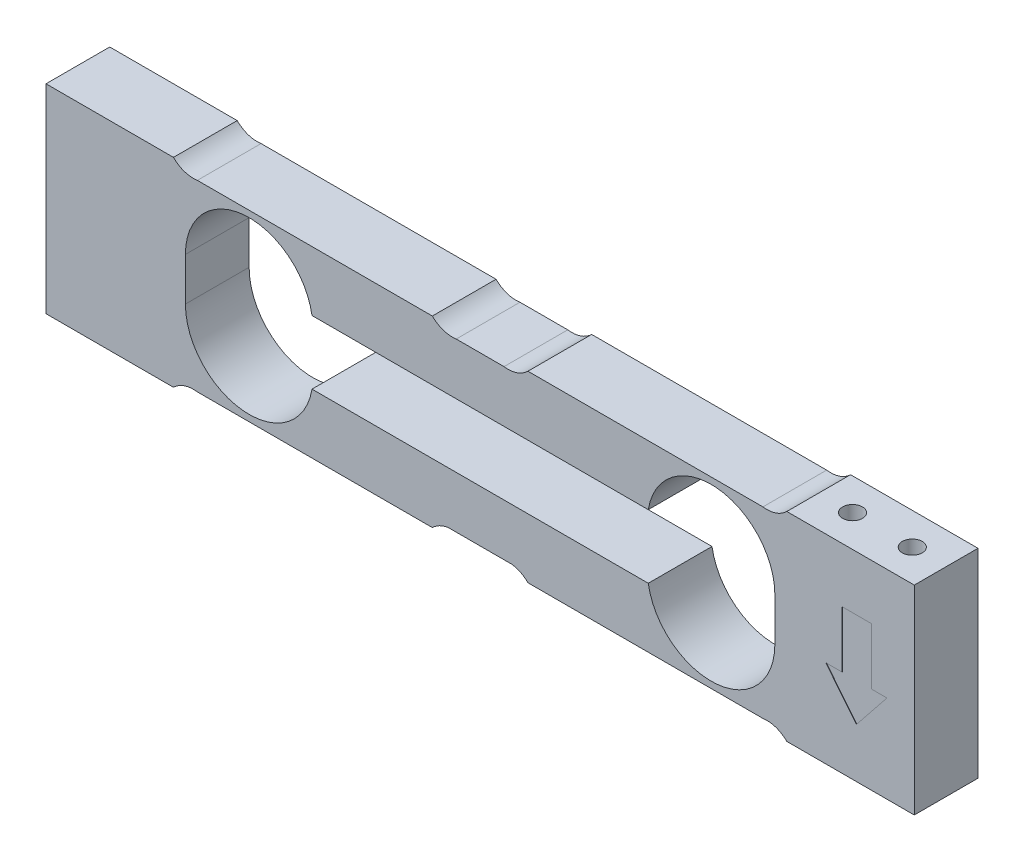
ISO-10303-21;
HEADER;
FILE_DESCRIPTION(('STEP AP214'),'2;1');
FILE_NAME('part.step','',(''),(''),'','','');
FILE_SCHEMA(('AUTOMOTIVE_DESIGN { 1 0 10303 214 1 1 1 1 }'));
ENDSEC;
DATA;
#1=APPLICATION_CONTEXT('core data for automotive mechanical design processes');
#2=APPLICATION_PROTOCOL_DEFINITION('international standard','automotive_design',2000,#1);
#3=PRODUCT_CONTEXT('',#1,'mechanical');
#4=PRODUCT('Part','Part','',(#3));
#5=PRODUCT_RELATED_PRODUCT_CATEGORY('part','',(#4));
#6=PRODUCT_DEFINITION_FORMATION('','',#4);
#7=PRODUCT_DEFINITION_CONTEXT('part definition',#1,'design');
#8=PRODUCT_DEFINITION('design','',#6,#7);
#9=PRODUCT_DEFINITION_SHAPE('','',#8);
#10=(LENGTH_UNIT() NAMED_UNIT(*) SI_UNIT(.MILLI.,.METRE.));
#11=(NAMED_UNIT(*) PLANE_ANGLE_UNIT() SI_UNIT($,.RADIAN.));
#12=(NAMED_UNIT(*) SI_UNIT($,.STERADIAN.) SOLID_ANGLE_UNIT());
#13=UNCERTAINTY_MEASURE_WITH_UNIT(LENGTH_MEASURE(1.E-05),#10,'distance_accuracy_value','');
#14=(GEOMETRIC_REPRESENTATION_CONTEXT(3) GLOBAL_UNCERTAINTY_ASSIGNED_CONTEXT((#13)) GLOBAL_UNIT_ASSIGNED_CONTEXT((#10,
#11,#12)) REPRESENTATION_CONTEXT('',''));
#15=CARTESIAN_POINT('',(0.,0.,0.));
#16=DIRECTION('',(0.,0.,1.));
#17=DIRECTION('',(1.,0.,0.));
#18=AXIS2_PLACEMENT_3D('',#15,#16,#17);
#19=CARTESIAN_POINT('',(219.735608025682,103.,8.));
#20=DIRECTION('',(0.,0.,1.));
#21=DIRECTION('',(1.,0.,0.));
#22=AXIS2_PLACEMENT_3D('',#19,#20,#21);
#23=PLANE('',#22);
#24=DIRECTION('',(0.,-1.,0.));
#25=VECTOR('',#24,1.);
#26=CARTESIAN_POINT('',(261.649638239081,122.620865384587,8.));
#27=LINE('',#26,#25);
#28=CARTESIAN_POINT('',(261.649638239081,122.620865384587,8.));
#29=VERTEX_POINT('',#28);
#30=CARTESIAN_POINT('',(261.649638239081,115.508562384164,8.));
#31=VERTEX_POINT('',#30);
#32=EDGE_CURVE('E45',#29,#31,#27,.T.);
#33=ORIENTED_EDGE('',*,*,#32,.F.);
#34=DIRECTION('',(-1.,0.,0.));
#35=VECTOR('',#34,1.);
#36=CARTESIAN_POINT('',(265.387022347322,122.620865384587,8.));
#37=LINE('',#36,#35);
#38=CARTESIAN_POINT('',(265.387022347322,122.620865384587,8.));
#39=VERTEX_POINT('',#38);
#40=EDGE_CURVE('E290',#39,#29,#37,.T.);
#41=ORIENTED_EDGE('',*,*,#40,.F.);
#42=DIRECTION('',(0.,1.,0.));
#43=VECTOR('',#42,1.);
#44=CARTESIAN_POINT('',(265.387022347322,115.508562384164,8.));
#45=LINE('',#44,#43);
#46=CARTESIAN_POINT('',(265.387022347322,115.508562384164,8.));
#47=VERTEX_POINT('',#46);
#48=EDGE_CURVE('E293',#47,#39,#45,.T.);
#49=ORIENTED_EDGE('',*,*,#48,.F.);
#50=DIRECTION('',(-1.,0.,0.));
#51=VECTOR('',#50,1.);
#52=CARTESIAN_POINT('',(267.307022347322,115.508562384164,8.));
#53=LINE('',#52,#51);
#54=CARTESIAN_POINT('',(267.307022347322,115.508562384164,8.));
#55=VERTEX_POINT('',#54);
#56=EDGE_CURVE('E315',#55,#47,#53,.T.);
#57=ORIENTED_EDGE('',*,*,#56,.F.);
#58=DIRECTION('',(0.624695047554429,0.780868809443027,0.));
#59=VECTOR('',#58,1.);
#60=CARTESIAN_POINT('',(263.467022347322,110.708562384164,8.));
#61=LINE('',#60,#59);
#62=CARTESIAN_POINT('',(263.467022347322,110.708562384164,8.));
#63=VERTEX_POINT('',#62);
#64=EDGE_CURVE('E312',#63,#55,#61,.T.);
#65=ORIENTED_EDGE('',*,*,#64,.F.);
#66=DIRECTION('',(0.624695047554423,-0.780868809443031,0.));
#67=VECTOR('',#66,1.);
#68=CARTESIAN_POINT('',(259.627022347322,115.508562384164,8.));
#69=LINE('',#68,#67);
#70=CARTESIAN_POINT('',(259.627022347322,115.508562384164,8.));
#71=VERTEX_POINT('',#70);
#72=EDGE_CURVE('E309',#71,#63,#69,.T.);
#73=ORIENTED_EDGE('',*,*,#72,.F.);
#74=DIRECTION('',(-1.,0.,0.));
#75=VECTOR('',#74,1.);
#76=CARTESIAN_POINT('',(261.649638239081,115.508562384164,8.));
#77=LINE('',#76,#75);
#78=EDGE_CURVE('E307',#31,#71,#77,.T.);
#79=ORIENTED_EDGE('',*,*,#78,.F.);
#80=EDGE_LOOP('',(#33,#41,#49,#57,#65,#73,#79));
#81=FACE_BOUND('',#80,.T.);
#82=CARTESIAN_POINT('',(219.735608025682,103.,8.));
#83=DIRECTION('',(0.,0.,-1.));
#84=DIRECTION('',(1.,0.,0.));
#85=AXIS2_PLACEMENT_3D('',#82,#83,#84);
#86=CIRCLE('',#85,3.53553390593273);
#87=CARTESIAN_POINT('',(220.235608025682,106.5,8.));
#88=VERTEX_POINT('',#87);
#89=CARTESIAN_POINT('',(222.235608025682,105.5,8.));
#90=VERTEX_POINT('',#89);
#91=EDGE_CURVE('E413',#88,#90,#86,.T.);
#92=ORIENTED_EDGE('',*,*,#91,.T.);
#93=DIRECTION('',(1.,0.,0.));
#94=VECTOR('',#93,1.);
#95=CARTESIAN_POINT('',(222.235608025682,105.5,8.));
#96=LINE('',#95,#94);
#97=CARTESIAN_POINT('',(251.735608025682,105.5,8.));
#98=VERTEX_POINT('',#97);
#99=EDGE_CURVE('E416',#90,#98,#96,.T.);
#100=ORIENTED_EDGE('',*,*,#99,.T.);
#101=CARTESIAN_POINT('',(252.235608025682,102.,8.));
#102=DIRECTION('',(0.,0.,-1.));
#103=DIRECTION('',(1.,0.,0.));
#104=AXIS2_PLACEMENT_3D('',#101,#102,#103);
#105=CIRCLE('',#104,3.53553390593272);
#106=CARTESIAN_POINT('',(254.735608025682,104.5,8.));
#107=VERTEX_POINT('',#106);
#108=EDGE_CURVE('E419',#98,#107,#105,.T.);
#109=ORIENTED_EDGE('',*,*,#108,.T.);
#110=DIRECTION('',(1.,0.,0.));
#111=VECTOR('',#110,1.);
#112=CARTESIAN_POINT('',(254.735608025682,104.5,8.));
#113=LINE('',#112,#111);
#114=CARTESIAN_POINT('',(270.735608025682,104.5,8.));
#115=VERTEX_POINT('',#114);
#116=EDGE_CURVE('E421',#107,#115,#113,.T.);
#117=ORIENTED_EDGE('',*,*,#116,.T.);
#118=DIRECTION('',(0.,1.,0.));
#119=VECTOR('',#118,1.);
#120=CARTESIAN_POINT('',(270.735608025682,129.5,8.));
#121=LINE('',#120,#119);
#122=CARTESIAN_POINT('',(270.735608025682,129.5,8.));
#123=VERTEX_POINT('',#122);
#124=EDGE_CURVE('E423',#115,#123,#121,.T.);
#125=ORIENTED_EDGE('',*,*,#124,.T.);
#126=DIRECTION('',(-1.,0.,0.));
#127=VECTOR('',#126,1.);
#128=CARTESIAN_POINT('',(254.735608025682,129.5,8.));
#129=LINE('',#128,#127);
#130=CARTESIAN_POINT('',(254.735608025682,129.5,8.));
#131=VERTEX_POINT('',#130);
#132=EDGE_CURVE('E425',#123,#131,#129,.T.);
#133=ORIENTED_EDGE('',*,*,#132,.T.);
#134=CARTESIAN_POINT('',(252.235608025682,132.,8.));
#135=DIRECTION('',(0.,0.,-1.));
#136=DIRECTION('',(1.,0.,0.));
#137=AXIS2_PLACEMENT_3D('',#134,#135,#136);
#138=CIRCLE('',#137,3.53553390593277);
#139=CARTESIAN_POINT('',(251.735608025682,128.5,8.));
#140=VERTEX_POINT('',#139);
#141=EDGE_CURVE('E427',#131,#140,#138,.T.);
#142=ORIENTED_EDGE('',*,*,#141,.T.);
#143=DIRECTION('',(-1.,0.,0.));
#144=VECTOR('',#143,1.);
#145=CARTESIAN_POINT('',(222.235608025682,128.5,8.));
#146=LINE('',#145,#144);
#147=CARTESIAN_POINT('',(222.235608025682,128.5,8.));
#148=VERTEX_POINT('',#147);
#149=EDGE_CURVE('E429',#140,#148,#146,.T.);
#150=ORIENTED_EDGE('',*,*,#149,.T.);
#151=CARTESIAN_POINT('',(219.735608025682,131.,8.));
#152=DIRECTION('',(0.,0.,-1.));
#153=DIRECTION('',(1.,0.,0.));
#154=AXIS2_PLACEMENT_3D('',#151,#152,#153);
#155=CIRCLE('',#154,3.53553390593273);
#156=CARTESIAN_POINT('',(219.235608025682,127.5,8.));
#157=VERTEX_POINT('',#156);
#158=EDGE_CURVE('E431',#148,#157,#155,.T.);
#159=ORIENTED_EDGE('',*,*,#158,.T.);
#160=DIRECTION('',(-1.,0.,0.));
#161=VECTOR('',#160,1.);
#162=CARTESIAN_POINT('',(213.235608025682,127.5,8.));
#163=LINE('',#162,#161);
#164=CARTESIAN_POINT('',(213.235608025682,127.5,8.));
#165=VERTEX_POINT('',#164);
#166=EDGE_CURVE('E433',#157,#165,#163,.T.);
#167=ORIENTED_EDGE('',*,*,#166,.T.);
#168=CARTESIAN_POINT('',(212.735608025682,131.,8.));
#169=DIRECTION('',(0.,0.,-1.));
#170=DIRECTION('',(1.,0.,0.));
#171=AXIS2_PLACEMENT_3D('',#168,#169,#170);
#172=CIRCLE('',#171,3.53553390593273);
#173=CARTESIAN_POINT('',(210.235608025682,128.5,8.));
#174=VERTEX_POINT('',#173);
#175=EDGE_CURVE('E435',#165,#174,#172,.T.);
#176=ORIENTED_EDGE('',*,*,#175,.T.);
#177=DIRECTION('',(-1.,0.,0.));
#178=VECTOR('',#177,1.);
#179=CARTESIAN_POINT('',(180.735608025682,128.5,8.));
#180=LINE('',#179,#178);
#181=CARTESIAN_POINT('',(180.735608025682,128.5,8.));
#182=VERTEX_POINT('',#181);
#183=EDGE_CURVE('E437',#174,#182,#180,.T.);
#184=ORIENTED_EDGE('',*,*,#183,.T.);
#185=CARTESIAN_POINT('',(180.235608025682,132.,8.));
#186=DIRECTION('',(0.,0.,-1.));
#187=DIRECTION('',(1.,0.,0.));
#188=AXIS2_PLACEMENT_3D('',#185,#186,#187);
#189=CIRCLE('',#188,3.53553390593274);
#190=CARTESIAN_POINT('',(177.735608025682,129.5,8.));
#191=VERTEX_POINT('',#190);
#192=EDGE_CURVE('E439',#182,#191,#189,.T.);
#193=ORIENTED_EDGE('',*,*,#192,.T.);
#194=DIRECTION('',(-1.,0.,0.));
#195=VECTOR('',#194,1.);
#196=CARTESIAN_POINT('',(161.735608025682,129.5,8.));
#197=LINE('',#196,#195);
#198=CARTESIAN_POINT('',(161.735608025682,129.5,8.));
#199=VERTEX_POINT('',#198);
#200=EDGE_CURVE('E441',#191,#199,#197,.T.);
#201=ORIENTED_EDGE('',*,*,#200,.T.);
#202=DIRECTION('',(0.,-1.,0.));
#203=VECTOR('',#202,1.);
#204=CARTESIAN_POINT('',(161.735608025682,129.5,8.));
#205=LINE('',#204,#203);
#206=CARTESIAN_POINT('',(161.735608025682,104.5,8.));
#207=VERTEX_POINT('',#206);
#208=EDGE_CURVE('E443',#199,#207,#205,.T.);
#209=ORIENTED_EDGE('',*,*,#208,.T.);
#210=DIRECTION('',(1.,0.,0.));
#211=VECTOR('',#210,1.);
#212=CARTESIAN_POINT('',(161.735608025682,104.5,8.));
#213=LINE('',#212,#211);
#214=CARTESIAN_POINT('',(177.735608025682,104.5,8.));
#215=VERTEX_POINT('',#214);
#216=EDGE_CURVE('E445',#207,#215,#213,.T.);
#217=ORIENTED_EDGE('',*,*,#216,.T.);
#218=CARTESIAN_POINT('',(180.235608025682,102.,8.));
#219=DIRECTION('',(0.,0.,-1.));
#220=DIRECTION('',(1.,0.,0.));
#221=AXIS2_PLACEMENT_3D('',#218,#219,#220);
#222=CIRCLE('',#221,3.53553390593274);
#223=CARTESIAN_POINT('',(180.735608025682,105.5,8.));
#224=VERTEX_POINT('',#223);
#225=EDGE_CURVE('E447',#215,#224,#222,.T.);
#226=ORIENTED_EDGE('',*,*,#225,.T.);
#227=DIRECTION('',(1.,0.,0.));
#228=VECTOR('',#227,1.);
#229=CARTESIAN_POINT('',(180.735608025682,105.5,8.));
#230=LINE('',#229,#228);
#231=CARTESIAN_POINT('',(210.235608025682,105.5,8.));
#232=VERTEX_POINT('',#231);
#233=EDGE_CURVE('E449',#224,#232,#230,.T.);
#234=ORIENTED_EDGE('',*,*,#233,.T.);
#235=CARTESIAN_POINT('',(212.735608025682,103.,8.));
#236=DIRECTION('',(0.,0.,-1.));
#237=DIRECTION('',(1.,0.,0.));
#238=AXIS2_PLACEMENT_3D('',#235,#236,#237);
#239=CIRCLE('',#238,3.53553390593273);
#240=CARTESIAN_POINT('',(212.235608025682,106.5,8.));
#241=VERTEX_POINT('',#240);
#242=EDGE_CURVE('E451',#232,#241,#239,.T.);
#243=ORIENTED_EDGE('',*,*,#242,.T.);
#244=DIRECTION('',(1.,0.,0.));
#245=VECTOR('',#244,1.);
#246=CARTESIAN_POINT('',(212.235608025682,106.5,8.));
#247=LINE('',#246,#245);
#248=EDGE_CURVE('E453',#241,#88,#247,.T.);
#249=ORIENTED_EDGE('',*,*,#248,.T.);
#250=EDGE_LOOP('',(#92,#100,#109,#117,#125,#133,#142,#150,#159,#167,#176,#184,#193,#201,#209,
#217,#226,#234,#243,#249));
#251=FACE_BOUND('',#250,.T.);
#252=DIRECTION('',(1.,0.,0.));
#253=VECTOR('',#252,1.);
#254=CARTESIAN_POINT('',(195.129276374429,113.,8.));
#255=LINE('',#254,#253);
#256=CARTESIAN_POINT('',(195.129276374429,113.,8.));
#257=VERTEX_POINT('',#256);
#258=CARTESIAN_POINT('',(237.341939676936,113.,8.));
#259=VERTEX_POINT('',#258);
#260=EDGE_CURVE('E358',#257,#259,#255,.T.);
#261=ORIENTED_EDGE('',*,*,#260,.F.);
#262=CARTESIAN_POINT('',(187.235608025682,114.3,8.));
#263=DIRECTION('',(0.,0.,1.));
#264=DIRECTION('',(1.,0.,0.));
#265=AXIS2_PLACEMENT_3D('',#262,#263,#264);
#266=CIRCLE('',#265,7.99999999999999);
#267=CARTESIAN_POINT('',(179.235608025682,114.3,8.));
#268=VERTEX_POINT('',#267);
#269=EDGE_CURVE('E356',#268,#257,#266,.T.);
#270=ORIENTED_EDGE('',*,*,#269,.F.);
#271=DIRECTION('',(0.,-1.,0.));
#272=VECTOR('',#271,1.);
#273=CARTESIAN_POINT('',(179.235608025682,119.7,8.));
#274=LINE('',#273,#272);
#275=CARTESIAN_POINT('',(179.235608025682,119.7,8.));
#276=VERTEX_POINT('',#275);
#277=EDGE_CURVE('E371',#276,#268,#274,.T.);
#278=ORIENTED_EDGE('',*,*,#277,.F.);
#279=CARTESIAN_POINT('',(187.235608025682,119.7,8.));
#280=DIRECTION('',(0.,0.,1.));
#281=DIRECTION('',(1.,0.,0.));
#282=AXIS2_PLACEMENT_3D('',#279,#280,#281);
#283=CIRCLE('',#282,8.00000000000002);
#284=CARTESIAN_POINT('',(195.129276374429,121.,8.));
#285=VERTEX_POINT('',#284);
#286=EDGE_CURVE('E369',#285,#276,#283,.T.);
#287=ORIENTED_EDGE('',*,*,#286,.F.);
#288=DIRECTION('',(-1.,0.,0.));
#289=VECTOR('',#288,1.);
#290=CARTESIAN_POINT('',(195.129276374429,121.,8.));
#291=LINE('',#290,#289);
#292=CARTESIAN_POINT('',(237.341939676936,121.,8.));
#293=VERTEX_POINT('',#292);
#294=EDGE_CURVE('E367',#293,#285,#291,.T.);
#295=ORIENTED_EDGE('',*,*,#294,.F.);
#296=CARTESIAN_POINT('',(245.235608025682,119.7,8.));
#297=DIRECTION('',(0.,0.,1.));
#298=DIRECTION('',(1.,0.,0.));
#299=AXIS2_PLACEMENT_3D('',#296,#297,#298);
#300=CIRCLE('',#299,7.99999999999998);
#301=CARTESIAN_POINT('',(253.235608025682,119.7,8.));
#302=VERTEX_POINT('',#301);
#303=EDGE_CURVE('E365',#302,#293,#300,.T.);
#304=ORIENTED_EDGE('',*,*,#303,.F.);
#305=DIRECTION('',(0.,1.,0.));
#306=VECTOR('',#305,1.);
#307=CARTESIAN_POINT('',(253.235608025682,119.7,8.));
#308=LINE('',#307,#306);
#309=CARTESIAN_POINT('',(253.235608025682,114.3,8.));
#310=VERTEX_POINT('',#309);
#311=EDGE_CURVE('E363',#310,#302,#308,.T.);
#312=ORIENTED_EDGE('',*,*,#311,.F.);
#313=CARTESIAN_POINT('',(245.235608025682,114.3,8.));
#314=DIRECTION('',(0.,0.,1.));
#315=DIRECTION('',(1.,0.,0.));
#316=AXIS2_PLACEMENT_3D('',#313,#314,#315);
#317=CIRCLE('',#316,7.99999999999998);
#318=EDGE_CURVE('E361',#259,#310,#317,.T.);
#319=ORIENTED_EDGE('',*,*,#318,.F.);
#320=EDGE_LOOP('',(#261,#270,#278,#287,#295,#304,#312,#319));
#321=FACE_BOUND('',#320,.T.);
#322=ADVANCED_FACE('F30',(#81,#251,#321),#23,.T.);
#323=CARTESIAN_POINT('',(219.735608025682,103.,0.));
#324=DIRECTION('',(0.,0.,1.));
#325=DIRECTION('',(1.,0.,0.));
#326=AXIS2_PLACEMENT_3D('',#323,#324,#325);
#327=PLANE('',#326);
#328=CARTESIAN_POINT('',(219.735608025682,103.,0.));
#329=DIRECTION('',(0.,0.,-1.));
#330=DIRECTION('',(1.,0.,0.));
#331=AXIS2_PLACEMENT_3D('',#328,#329,#330);
#332=CIRCLE('',#331,3.53553390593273);
#333=CARTESIAN_POINT('',(220.235608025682,106.5,0.));
#334=VERTEX_POINT('',#333);
#335=CARTESIAN_POINT('',(222.235608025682,105.5,0.));
#336=VERTEX_POINT('',#335);
#337=EDGE_CURVE('E412',#334,#336,#332,.T.);
#338=ORIENTED_EDGE('',*,*,#337,.F.);
#339=DIRECTION('',(1.,0.,0.));
#340=VECTOR('',#339,1.);
#341=CARTESIAN_POINT('',(212.235608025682,106.5,0.));
#342=LINE('',#341,#340);
#343=CARTESIAN_POINT('',(212.235608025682,106.5,0.));
#344=VERTEX_POINT('',#343);
#345=EDGE_CURVE('E417',#344,#334,#342,.T.);
#346=ORIENTED_EDGE('',*,*,#345,.F.);
#347=CARTESIAN_POINT('',(212.735608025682,103.,0.));
#348=DIRECTION('',(0.,0.,-1.));
#349=DIRECTION('',(1.,0.,0.));
#350=AXIS2_PLACEMENT_3D('',#347,#348,#349);
#351=CIRCLE('',#350,3.53553390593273);
#352=CARTESIAN_POINT('',(210.235608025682,105.5,0.));
#353=VERTEX_POINT('',#352);
#354=EDGE_CURVE('E492',#353,#344,#351,.T.);
#355=ORIENTED_EDGE('',*,*,#354,.F.);
#356=DIRECTION('',(1.,0.,0.));
#357=VECTOR('',#356,1.);
#358=CARTESIAN_POINT('',(180.735608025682,105.5,0.));
#359=LINE('',#358,#357);
#360=CARTESIAN_POINT('',(180.735608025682,105.5,0.));
#361=VERTEX_POINT('',#360);
#362=EDGE_CURVE('E490',#361,#353,#359,.T.);
#363=ORIENTED_EDGE('',*,*,#362,.F.);
#364=CARTESIAN_POINT('',(180.235608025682,102.,0.));
#365=DIRECTION('',(0.,0.,-1.));
#366=DIRECTION('',(1.,0.,0.));
#367=AXIS2_PLACEMENT_3D('',#364,#365,#366);
#368=CIRCLE('',#367,3.53553390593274);
#369=CARTESIAN_POINT('',(177.735608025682,104.5,0.));
#370=VERTEX_POINT('',#369);
#371=EDGE_CURVE('E488',#370,#361,#368,.T.);
#372=ORIENTED_EDGE('',*,*,#371,.F.);
#373=DIRECTION('',(1.,0.,0.));
#374=VECTOR('',#373,1.);
#375=CARTESIAN_POINT('',(161.735608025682,104.5,0.));
#376=LINE('',#375,#374);
#377=CARTESIAN_POINT('',(161.735608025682,104.5,0.));
#378=VERTEX_POINT('',#377);
#379=EDGE_CURVE('E486',#378,#370,#376,.T.);
#380=ORIENTED_EDGE('',*,*,#379,.F.);
#381=DIRECTION('',(0.,-1.,0.));
#382=VECTOR('',#381,1.);
#383=CARTESIAN_POINT('',(161.735608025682,129.5,0.));
#384=LINE('',#383,#382);
#385=CARTESIAN_POINT('',(161.735608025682,129.5,0.));
#386=VERTEX_POINT('',#385);
#387=EDGE_CURVE('E484',#386,#378,#384,.T.);
#388=ORIENTED_EDGE('',*,*,#387,.F.);
#389=DIRECTION('',(-1.,0.,0.));
#390=VECTOR('',#389,1.);
#391=CARTESIAN_POINT('',(161.735608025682,129.5,0.));
#392=LINE('',#391,#390);
#393=CARTESIAN_POINT('',(177.735608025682,129.5,0.));
#394=VERTEX_POINT('',#393);
#395=EDGE_CURVE('E482',#394,#386,#392,.T.);
#396=ORIENTED_EDGE('',*,*,#395,.F.);
#397=CARTESIAN_POINT('',(180.235608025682,132.,0.));
#398=DIRECTION('',(0.,0.,-1.));
#399=DIRECTION('',(1.,0.,0.));
#400=AXIS2_PLACEMENT_3D('',#397,#398,#399);
#401=CIRCLE('',#400,3.53553390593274);
#402=CARTESIAN_POINT('',(180.735608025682,128.5,0.));
#403=VERTEX_POINT('',#402);
#404=EDGE_CURVE('E480',#403,#394,#401,.T.);
#405=ORIENTED_EDGE('',*,*,#404,.F.);
#406=DIRECTION('',(-1.,0.,0.));
#407=VECTOR('',#406,1.);
#408=CARTESIAN_POINT('',(180.735608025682,128.5,0.));
#409=LINE('',#408,#407);
#410=CARTESIAN_POINT('',(210.235608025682,128.5,0.));
#411=VERTEX_POINT('',#410);
#412=EDGE_CURVE('E478',#411,#403,#409,.T.);
#413=ORIENTED_EDGE('',*,*,#412,.F.);
#414=CARTESIAN_POINT('',(212.735608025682,131.,0.));
#415=DIRECTION('',(0.,0.,-1.));
#416=DIRECTION('',(1.,0.,0.));
#417=AXIS2_PLACEMENT_3D('',#414,#415,#416);
#418=CIRCLE('',#417,3.53553390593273);
#419=CARTESIAN_POINT('',(213.235608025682,127.5,0.));
#420=VERTEX_POINT('',#419);
#421=EDGE_CURVE('E476',#420,#411,#418,.T.);
#422=ORIENTED_EDGE('',*,*,#421,.F.);
#423=DIRECTION('',(-1.,0.,0.));
#424=VECTOR('',#423,1.);
#425=CARTESIAN_POINT('',(213.235608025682,127.5,0.));
#426=LINE('',#425,#424);
#427=CARTESIAN_POINT('',(219.235608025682,127.5,0.));
#428=VERTEX_POINT('',#427);
#429=EDGE_CURVE('E474',#428,#420,#426,.T.);
#430=ORIENTED_EDGE('',*,*,#429,.F.);
#431=CARTESIAN_POINT('',(219.735608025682,131.,0.));
#432=DIRECTION('',(0.,0.,-1.));
#433=DIRECTION('',(1.,0.,0.));
#434=AXIS2_PLACEMENT_3D('',#431,#432,#433);
#435=CIRCLE('',#434,3.53553390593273);
#436=CARTESIAN_POINT('',(222.235608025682,128.5,0.));
#437=VERTEX_POINT('',#436);
#438=EDGE_CURVE('E472',#437,#428,#435,.T.);
#439=ORIENTED_EDGE('',*,*,#438,.F.);
#440=DIRECTION('',(-1.,0.,0.));
#441=VECTOR('',#440,1.);
#442=CARTESIAN_POINT('',(222.235608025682,128.5,0.));
#443=LINE('',#442,#441);
#444=CARTESIAN_POINT('',(251.735608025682,128.5,0.));
#445=VERTEX_POINT('',#444);
#446=EDGE_CURVE('E470',#445,#437,#443,.T.);
#447=ORIENTED_EDGE('',*,*,#446,.F.);
#448=CARTESIAN_POINT('',(252.235608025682,132.,0.));
#449=DIRECTION('',(0.,0.,-1.));
#450=DIRECTION('',(1.,0.,0.));
#451=AXIS2_PLACEMENT_3D('',#448,#449,#450);
#452=CIRCLE('',#451,3.53553390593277);
#453=CARTESIAN_POINT('',(254.735608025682,129.5,0.));
#454=VERTEX_POINT('',#453);
#455=EDGE_CURVE('E468',#454,#445,#452,.T.);
#456=ORIENTED_EDGE('',*,*,#455,.F.);
#457=DIRECTION('',(-1.,0.,0.));
#458=VECTOR('',#457,1.);
#459=CARTESIAN_POINT('',(254.735608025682,129.5,0.));
#460=LINE('',#459,#458);
#461=CARTESIAN_POINT('',(270.735608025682,129.5,0.));
#462=VERTEX_POINT('',#461);
#463=EDGE_CURVE('E466',#462,#454,#460,.T.);
#464=ORIENTED_EDGE('',*,*,#463,.F.);
#465=DIRECTION('',(0.,1.,0.));
#466=VECTOR('',#465,1.);
#467=CARTESIAN_POINT('',(270.735608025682,129.5,0.));
#468=LINE('',#467,#466);
#469=CARTESIAN_POINT('',(270.735608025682,104.5,0.));
#470=VERTEX_POINT('',#469);
#471=EDGE_CURVE('E464',#470,#462,#468,.T.);
#472=ORIENTED_EDGE('',*,*,#471,.F.);
#473=DIRECTION('',(1.,0.,0.));
#474=VECTOR('',#473,1.);
#475=CARTESIAN_POINT('',(254.735608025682,104.5,0.));
#476=LINE('',#475,#474);
#477=CARTESIAN_POINT('',(254.735608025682,104.5,0.));
#478=VERTEX_POINT('',#477);
#479=EDGE_CURVE('E462',#478,#470,#476,.T.);
#480=ORIENTED_EDGE('',*,*,#479,.F.);
#481=CARTESIAN_POINT('',(252.235608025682,102.,0.));
#482=DIRECTION('',(0.,0.,-1.));
#483=DIRECTION('',(1.,0.,0.));
#484=AXIS2_PLACEMENT_3D('',#481,#482,#483);
#485=CIRCLE('',#484,3.53553390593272);
#486=CARTESIAN_POINT('',(251.735608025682,105.5,0.));
#487=VERTEX_POINT('',#486);
#488=EDGE_CURVE('E460',#487,#478,#485,.T.);
#489=ORIENTED_EDGE('',*,*,#488,.F.);
#490=DIRECTION('',(1.,0.,0.));
#491=VECTOR('',#490,1.);
#492=CARTESIAN_POINT('',(222.235608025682,105.5,0.));
#493=LINE('',#492,#491);
#494=EDGE_CURVE('E458',#336,#487,#493,.T.);
#495=ORIENTED_EDGE('',*,*,#494,.F.);
#496=EDGE_LOOP('',(#338,#346,#355,#363,#372,#380,#388,#396,#405,#413,#422,#430,#439,#447,#456,
#464,#472,#480,#489,#495));
#497=FACE_BOUND('',#496,.T.);
#498=CARTESIAN_POINT('',(187.235608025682,114.3,0.));
#499=DIRECTION('',(0.,0.,1.));
#500=DIRECTION('',(1.,0.,0.));
#501=AXIS2_PLACEMENT_3D('',#498,#499,#500);
#502=CIRCLE('',#501,7.99999999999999);
#503=CARTESIAN_POINT('',(179.235608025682,114.3,0.));
#504=VERTEX_POINT('',#503);
#505=CARTESIAN_POINT('',(195.129276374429,113.,0.));
#506=VERTEX_POINT('',#505);
#507=EDGE_CURVE('E355',#504,#506,#502,.T.);
#508=ORIENTED_EDGE('',*,*,#507,.T.);
#509=DIRECTION('',(1.,0.,0.));
#510=VECTOR('',#509,1.);
#511=CARTESIAN_POINT('',(195.129276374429,113.,0.));
#512=LINE('',#511,#510);
#513=CARTESIAN_POINT('',(237.341939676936,113.,0.));
#514=VERTEX_POINT('',#513);
#515=EDGE_CURVE('E376',#506,#514,#512,.T.);
#516=ORIENTED_EDGE('',*,*,#515,.T.);
#517=CARTESIAN_POINT('',(245.235608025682,114.3,0.));
#518=DIRECTION('',(0.,0.,1.));
#519=DIRECTION('',(1.,0.,0.));
#520=AXIS2_PLACEMENT_3D('',#517,#518,#519);
#521=CIRCLE('',#520,7.99999999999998);
#522=CARTESIAN_POINT('',(253.235608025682,114.3,0.));
#523=VERTEX_POINT('',#522);
#524=EDGE_CURVE('E379',#514,#523,#521,.T.);
#525=ORIENTED_EDGE('',*,*,#524,.T.);
#526=DIRECTION('',(0.,1.,0.));
#527=VECTOR('',#526,1.);
#528=CARTESIAN_POINT('',(253.235608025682,119.7,0.));
#529=LINE('',#528,#527);
#530=CARTESIAN_POINT('',(253.235608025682,119.7,0.));
#531=VERTEX_POINT('',#530);
#532=EDGE_CURVE('E382',#523,#531,#529,.T.);
#533=ORIENTED_EDGE('',*,*,#532,.T.);
#534=CARTESIAN_POINT('',(245.235608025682,119.7,0.));
#535=DIRECTION('',(0.,0.,1.));
#536=DIRECTION('',(1.,0.,0.));
#537=AXIS2_PLACEMENT_3D('',#534,#535,#536);
#538=CIRCLE('',#537,7.99999999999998);
#539=CARTESIAN_POINT('',(237.341939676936,121.,0.));
#540=VERTEX_POINT('',#539);
#541=EDGE_CURVE('E385',#531,#540,#538,.T.);
#542=ORIENTED_EDGE('',*,*,#541,.T.);
#543=DIRECTION('',(-1.,0.,0.));
#544=VECTOR('',#543,1.);
#545=CARTESIAN_POINT('',(195.129276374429,121.,0.));
#546=LINE('',#545,#544);
#547=CARTESIAN_POINT('',(195.129276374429,121.,0.));
#548=VERTEX_POINT('',#547);
#549=EDGE_CURVE('E388',#540,#548,#546,.T.);
#550=ORIENTED_EDGE('',*,*,#549,.T.);
#551=CARTESIAN_POINT('',(187.235608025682,119.7,0.));
#552=DIRECTION('',(0.,0.,1.));
#553=DIRECTION('',(1.,0.,0.));
#554=AXIS2_PLACEMENT_3D('',#551,#552,#553);
#555=CIRCLE('',#554,8.00000000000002);
#556=CARTESIAN_POINT('',(179.235608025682,119.7,0.));
#557=VERTEX_POINT('',#556);
#558=EDGE_CURVE('E391',#548,#557,#555,.T.);
#559=ORIENTED_EDGE('',*,*,#558,.T.);
#560=DIRECTION('',(0.,-1.,0.));
#561=VECTOR('',#560,1.);
#562=CARTESIAN_POINT('',(179.235608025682,119.7,0.));
#563=LINE('',#562,#561);
#564=EDGE_CURVE('E359',#557,#504,#563,.T.);
#565=ORIENTED_EDGE('',*,*,#564,.T.);
#566=EDGE_LOOP('',(#508,#516,#525,#533,#542,#550,#559,#565));
#567=FACE_BOUND('',#566,.T.);
#568=ADVANCED_FACE('F558',(#497,#567),#327,.F.);
#569=CARTESIAN_POINT('',(219.735608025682,103.,8.));
#570=DIRECTION('',(0.,0.,-1.));
#571=DIRECTION('',(-1.,0.,0.));
#572=AXIS2_PLACEMENT_3D('',#569,#570,#571);
#573=CYLINDRICAL_SURFACE('',#572,3.53553390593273);
#574=ORIENTED_EDGE('',*,*,#337,.T.);
#575=DIRECTION('',(0.,0.,-1.));
#576=VECTOR('',#575,1.);
#577=CARTESIAN_POINT('',(222.235608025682,105.5,8.));
#578=LINE('',#577,#576);
#579=EDGE_CURVE('E11',#90,#336,#578,.T.);
#580=ORIENTED_EDGE('',*,*,#579,.F.);
#581=ORIENTED_EDGE('',*,*,#91,.F.);
#582=DIRECTION('',(0.,0.,-1.));
#583=VECTOR('',#582,1.);
#584=CARTESIAN_POINT('',(220.235608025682,106.5,8.));
#585=LINE('',#584,#583);
#586=EDGE_CURVE('E455',#88,#334,#585,.T.);
#587=ORIENTED_EDGE('',*,*,#586,.T.);
#588=EDGE_LOOP('',(#574,#580,#581,#587));
#589=FACE_BOUND('',#588,.T.);
#590=ADVANCED_FACE('F32',(#589),#573,.F.);
#591=CARTESIAN_POINT('',(222.235608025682,105.5,8.));
#592=DIRECTION('',(0.,1.,0.));
#593=DIRECTION('',(0.,0.,1.));
#594=AXIS2_PLACEMENT_3D('',#591,#592,#593);
#595=PLANE('',#594);
#596=ORIENTED_EDGE('',*,*,#494,.T.);
#597=DIRECTION('',(0.,0.,-1.));
#598=VECTOR('',#597,1.);
#599=CARTESIAN_POINT('',(251.735608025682,105.5,8.));
#600=LINE('',#599,#598);
#601=EDGE_CURVE('E38',#98,#487,#600,.T.);
#602=ORIENTED_EDGE('',*,*,#601,.F.);
#603=ORIENTED_EDGE('',*,*,#99,.F.);
#604=ORIENTED_EDGE('',*,*,#579,.T.);
#605=EDGE_LOOP('',(#596,#602,#603,#604));
#606=FACE_BOUND('',#605,.T.);
#607=ADVANCED_FACE('F576',(#606),#595,.F.);
#608=CARTESIAN_POINT('',(252.235608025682,102.,8.));
#609=DIRECTION('',(0.,0.,-1.));
#610=DIRECTION('',(-1.,0.,0.));
#611=AXIS2_PLACEMENT_3D('',#608,#609,#610);
#612=CYLINDRICAL_SURFACE('',#611,3.53553390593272);
#613=ORIENTED_EDGE('',*,*,#488,.T.);
#614=DIRECTION('',(0.,0.,-1.));
#615=VECTOR('',#614,1.);
#616=CARTESIAN_POINT('',(254.735608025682,104.5,8.));
#617=LINE('',#616,#615);
#618=EDGE_CURVE('E545',#107,#478,#617,.T.);
#619=ORIENTED_EDGE('',*,*,#618,.F.);
#620=ORIENTED_EDGE('',*,*,#108,.F.);
#621=ORIENTED_EDGE('',*,*,#601,.T.);
#622=EDGE_LOOP('',(#613,#619,#620,#621));
#623=FACE_BOUND('',#622,.T.);
#624=ADVANCED_FACE('F552',(#623),#612,.F.);
#625=CARTESIAN_POINT('',(254.735608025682,104.5,8.));
#626=DIRECTION('',(0.,1.,0.));
#627=DIRECTION('',(0.,0.,1.));
#628=AXIS2_PLACEMENT_3D('',#625,#626,#627);
#629=PLANE('',#628);
#630=ORIENTED_EDGE('',*,*,#479,.T.);
#631=DIRECTION('',(0.,0.,-1.));
#632=VECTOR('',#631,1.);
#633=CARTESIAN_POINT('',(270.735608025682,104.5,8.));
#634=LINE('',#633,#632);
#635=EDGE_CURVE('E542',#115,#470,#634,.T.);
#636=ORIENTED_EDGE('',*,*,#635,.F.);
#637=ORIENTED_EDGE('',*,*,#116,.F.);
#638=ORIENTED_EDGE('',*,*,#618,.T.);
#639=EDGE_LOOP('',(#630,#636,#637,#638));
#640=FACE_BOUND('',#639,.T.);
#641=ADVANCED_FACE('F564',(#640),#629,.F.);
#642=CARTESIAN_POINT('',(270.735608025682,129.5,8.));
#643=DIRECTION('',(-1.,0.,0.));
#644=DIRECTION('',(0.,0.,1.));
#645=AXIS2_PLACEMENT_3D('',#642,#643,#644);
#646=PLANE('',#645);
#647=ORIENTED_EDGE('',*,*,#471,.T.);
#648=DIRECTION('',(0.,0.,-1.));
#649=VECTOR('',#648,1.);
#650=CARTESIAN_POINT('',(270.735608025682,129.5,8.));
#651=LINE('',#650,#649);
#652=EDGE_CURVE('E539',#123,#462,#651,.T.);
#653=ORIENTED_EDGE('',*,*,#652,.F.);
#654=ORIENTED_EDGE('',*,*,#124,.F.);
#655=ORIENTED_EDGE('',*,*,#635,.T.);
#656=EDGE_LOOP('',(#647,#653,#654,#655));
#657=FACE_BOUND('',#656,.T.);
#658=ADVANCED_FACE('F568',(#657),#646,.F.);
#659=CARTESIAN_POINT('',(254.735608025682,129.5,8.));
#660=DIRECTION('',(0.,-1.,0.));
#661=DIRECTION('',(0.,0.,-1.));
#662=AXIS2_PLACEMENT_3D('',#659,#660,#661);
#663=PLANE('',#662);
#664=CARTESIAN_POINT('',(266.485608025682,129.5,4.));
#665=DIRECTION('',(0.,1.,0.));
#666=DIRECTION('',(0.,0.,1.));
#667=AXIS2_PLACEMENT_3D('',#664,#665,#666);
#668=CIRCLE('',#667,1.24999999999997);
#669=CARTESIAN_POINT('',(266.485608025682,129.5,5.24999999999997));
#670=VERTEX_POINT('',#669);
#671=EDGE_CURVE('E322',#670,#670,#668,.T.);
#672=ORIENTED_EDGE('',*,*,#671,.F.);
#673=EDGE_LOOP('',(#672));
#674=FACE_BOUND('',#673,.T.);
#675=CARTESIAN_POINT('',(258.985608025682,129.5,4.));
#676=DIRECTION('',(0.,1.,0.));
#677=DIRECTION('',(0.,0.,1.));
#678=AXIS2_PLACEMENT_3D('',#675,#676,#677);
#679=CIRCLE('',#678,1.24999999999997);
#680=CARTESIAN_POINT('',(258.985608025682,129.5,5.24999999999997));
#681=VERTEX_POINT('',#680);
#682=EDGE_CURVE('E337',#681,#681,#679,.T.);
#683=ORIENTED_EDGE('',*,*,#682,.F.);
#684=EDGE_LOOP('',(#683));
#685=FACE_BOUND('',#684,.T.);
#686=ORIENTED_EDGE('',*,*,#463,.T.);
#687=DIRECTION('',(0.,0.,-1.));
#688=VECTOR('',#687,1.);
#689=CARTESIAN_POINT('',(254.735608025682,129.5,8.));
#690=LINE('',#689,#688);
#691=EDGE_CURVE('E536',#131,#454,#690,.T.);
#692=ORIENTED_EDGE('',*,*,#691,.F.);
#693=ORIENTED_EDGE('',*,*,#132,.F.);
#694=ORIENTED_EDGE('',*,*,#652,.T.);
#695=EDGE_LOOP('',(#686,#692,#693,#694));
#696=FACE_BOUND('',#695,.T.);
#697=ADVANCED_FACE('F649',(#674,#685,#696),#663,.F.);
#698=CARTESIAN_POINT('',(252.235608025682,132.,8.));
#699=DIRECTION('',(0.,0.,-1.));
#700=DIRECTION('',(-1.,0.,0.));
#701=AXIS2_PLACEMENT_3D('',#698,#699,#700);
#702=CYLINDRICAL_SURFACE('',#701,3.53553390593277);
#703=ORIENTED_EDGE('',*,*,#455,.T.);
#704=DIRECTION('',(0.,0.,-1.));
#705=VECTOR('',#704,1.);
#706=CARTESIAN_POINT('',(251.735608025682,128.5,8.));
#707=LINE('',#706,#705);
#708=EDGE_CURVE('E533',#140,#445,#707,.T.);
#709=ORIENTED_EDGE('',*,*,#708,.F.);
#710=ORIENTED_EDGE('',*,*,#141,.F.);
#711=ORIENTED_EDGE('',*,*,#691,.T.);
#712=EDGE_LOOP('',(#703,#709,#710,#711));
#713=FACE_BOUND('',#712,.T.);
#714=ADVANCED_FACE('F647',(#713),#702,.F.);
#715=CARTESIAN_POINT('',(222.235608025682,128.5,8.));
#716=DIRECTION('',(0.,-1.,0.));
#717=DIRECTION('',(0.,0.,-1.));
#718=AXIS2_PLACEMENT_3D('',#715,#716,#717);
#719=PLANE('',#718);
#720=ORIENTED_EDGE('',*,*,#446,.T.);
#721=DIRECTION('',(0.,0.,-1.));
#722=VECTOR('',#721,1.);
#723=CARTESIAN_POINT('',(222.235608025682,128.5,8.));
#724=LINE('',#723,#722);
#725=EDGE_CURVE('E530',#148,#437,#724,.T.);
#726=ORIENTED_EDGE('',*,*,#725,.F.);
#727=ORIENTED_EDGE('',*,*,#149,.F.);
#728=ORIENTED_EDGE('',*,*,#708,.T.);
#729=EDGE_LOOP('',(#720,#726,#727,#728));
#730=FACE_BOUND('',#729,.T.);
#731=ADVANCED_FACE('F642',(#730),#719,.F.);
#732=CARTESIAN_POINT('',(219.735608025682,131.,8.));
#733=DIRECTION('',(0.,0.,-1.));
#734=DIRECTION('',(-1.,0.,0.));
#735=AXIS2_PLACEMENT_3D('',#732,#733,#734);
#736=CYLINDRICAL_SURFACE('',#735,3.53553390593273);
#737=ORIENTED_EDGE('',*,*,#438,.T.);
#738=DIRECTION('',(0.,0.,-1.));
#739=VECTOR('',#738,1.);
#740=CARTESIAN_POINT('',(219.235608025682,127.5,8.));
#741=LINE('',#740,#739);
#742=EDGE_CURVE('E527',#157,#428,#741,.T.);
#743=ORIENTED_EDGE('',*,*,#742,.F.);
#744=ORIENTED_EDGE('',*,*,#158,.F.);
#745=ORIENTED_EDGE('',*,*,#725,.T.);
#746=EDGE_LOOP('',(#737,#743,#744,#745));
#747=FACE_BOUND('',#746,.T.);
#748=ADVANCED_FACE('F637',(#747),#736,.F.);
#749=CARTESIAN_POINT('',(213.235608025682,127.5,8.));
#750=DIRECTION('',(0.,-1.,0.));
#751=DIRECTION('',(0.,0.,-1.));
#752=AXIS2_PLACEMENT_3D('',#749,#750,#751);
#753=PLANE('',#752);
#754=ORIENTED_EDGE('',*,*,#429,.T.);
#755=DIRECTION('',(0.,0.,-1.));
#756=VECTOR('',#755,1.);
#757=CARTESIAN_POINT('',(213.235608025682,127.5,8.));
#758=LINE('',#757,#756);
#759=EDGE_CURVE('E524',#165,#420,#758,.T.);
#760=ORIENTED_EDGE('',*,*,#759,.F.);
#761=ORIENTED_EDGE('',*,*,#166,.F.);
#762=ORIENTED_EDGE('',*,*,#742,.T.);
#763=EDGE_LOOP('',(#754,#760,#761,#762));
#764=FACE_BOUND('',#763,.T.);
#765=ADVANCED_FACE('F633',(#764),#753,.F.);
#766=CARTESIAN_POINT('',(212.735608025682,131.,8.));
#767=DIRECTION('',(0.,0.,-1.));
#768=DIRECTION('',(-1.,0.,0.));
#769=AXIS2_PLACEMENT_3D('',#766,#767,#768);
#770=CYLINDRICAL_SURFACE('',#769,3.53553390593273);
#771=ORIENTED_EDGE('',*,*,#421,.T.);
#772=DIRECTION('',(0.,0.,-1.));
#773=VECTOR('',#772,1.);
#774=CARTESIAN_POINT('',(210.235608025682,128.5,8.));
#775=LINE('',#774,#773);
#776=EDGE_CURVE('E521',#174,#411,#775,.T.);
#777=ORIENTED_EDGE('',*,*,#776,.F.);
#778=ORIENTED_EDGE('',*,*,#175,.F.);
#779=ORIENTED_EDGE('',*,*,#759,.T.);
#780=EDGE_LOOP('',(#771,#777,#778,#779));
#781=FACE_BOUND('',#780,.T.);
#782=ADVANCED_FACE('F628',(#781),#770,.F.);
#783=CARTESIAN_POINT('',(180.735608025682,128.5,8.));
#784=DIRECTION('',(0.,-1.,0.));
#785=DIRECTION('',(0.,0.,-1.));
#786=AXIS2_PLACEMENT_3D('',#783,#784,#785);
#787=PLANE('',#786);
#788=ORIENTED_EDGE('',*,*,#412,.T.);
#789=DIRECTION('',(0.,0.,-1.));
#790=VECTOR('',#789,1.);
#791=CARTESIAN_POINT('',(180.735608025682,128.5,8.));
#792=LINE('',#791,#790);
#793=EDGE_CURVE('E518',#182,#403,#792,.T.);
#794=ORIENTED_EDGE('',*,*,#793,.F.);
#795=ORIENTED_EDGE('',*,*,#183,.F.);
#796=ORIENTED_EDGE('',*,*,#776,.T.);
#797=EDGE_LOOP('',(#788,#794,#795,#796));
#798=FACE_BOUND('',#797,.T.);
#799=ADVANCED_FACE('F622',(#798),#787,.F.);
#800=CARTESIAN_POINT('',(180.235608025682,132.,8.));
#801=DIRECTION('',(0.,0.,-1.));
#802=DIRECTION('',(-1.,0.,0.));
#803=AXIS2_PLACEMENT_3D('',#800,#801,#802);
#804=CYLINDRICAL_SURFACE('',#803,3.53553390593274);
#805=ORIENTED_EDGE('',*,*,#404,.T.);
#806=DIRECTION('',(0.,0.,-1.));
#807=VECTOR('',#806,1.);
#808=CARTESIAN_POINT('',(177.735608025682,129.5,8.));
#809=LINE('',#808,#807);
#810=EDGE_CURVE('E515',#191,#394,#809,.T.);
#811=ORIENTED_EDGE('',*,*,#810,.F.);
#812=ORIENTED_EDGE('',*,*,#192,.F.);
#813=ORIENTED_EDGE('',*,*,#793,.T.);
#814=EDGE_LOOP('',(#805,#811,#812,#813));
#815=FACE_BOUND('',#814,.T.);
#816=ADVANCED_FACE('F618',(#815),#804,.F.);
#817=CARTESIAN_POINT('',(161.735608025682,129.5,8.));
#818=DIRECTION('',(0.,-1.,0.));
#819=DIRECTION('',(0.,0.,-1.));
#820=AXIS2_PLACEMENT_3D('',#817,#818,#819);
#821=PLANE('',#820);
#822=ORIENTED_EDGE('',*,*,#395,.T.);
#823=DIRECTION('',(0.,0.,-1.));
#824=VECTOR('',#823,1.);
#825=CARTESIAN_POINT('',(161.735608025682,129.5,8.));
#826=LINE('',#825,#824);
#827=EDGE_CURVE('E512',#199,#386,#826,.T.);
#828=ORIENTED_EDGE('',*,*,#827,.F.);
#829=ORIENTED_EDGE('',*,*,#200,.F.);
#830=ORIENTED_EDGE('',*,*,#810,.T.);
#831=EDGE_LOOP('',(#822,#828,#829,#830));
#832=FACE_BOUND('',#831,.T.);
#833=ADVANCED_FACE('F613',(#832),#821,.F.);
#834=CARTESIAN_POINT('',(161.735608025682,129.5,8.));
#835=DIRECTION('',(1.,0.,0.));
#836=DIRECTION('',(0.,0.,-1.));
#837=AXIS2_PLACEMENT_3D('',#834,#835,#836);
#838=PLANE('',#837);
#839=ORIENTED_EDGE('',*,*,#387,.T.);
#840=DIRECTION('',(0.,0.,-1.));
#841=VECTOR('',#840,1.);
#842=CARTESIAN_POINT('',(161.735608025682,104.5,8.));
#843=LINE('',#842,#841);
#844=EDGE_CURVE('E509',#207,#378,#843,.T.);
#845=ORIENTED_EDGE('',*,*,#844,.F.);
#846=ORIENTED_EDGE('',*,*,#208,.F.);
#847=ORIENTED_EDGE('',*,*,#827,.T.);
#848=EDGE_LOOP('',(#839,#845,#846,#847));
#849=FACE_BOUND('',#848,.T.);
#850=ADVANCED_FACE('F607',(#849),#838,.F.);
#851=CARTESIAN_POINT('',(161.735608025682,104.5,8.));
#852=DIRECTION('',(0.,1.,0.));
#853=DIRECTION('',(0.,0.,1.));
#854=AXIS2_PLACEMENT_3D('',#851,#852,#853);
#855=PLANE('',#854);
#856=CARTESIAN_POINT('',(165.985608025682,104.5,4.));
#857=DIRECTION('',(0.,-1.,0.));
#858=DIRECTION('',(0.,0.,-1.));
#859=AXIS2_PLACEMENT_3D('',#856,#857,#858);
#860=CIRCLE('',#859,1.25);
#861=CARTESIAN_POINT('',(165.985608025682,104.5,2.75));
#862=VERTEX_POINT('',#861);
#863=EDGE_CURVE('E343',#862,#862,#860,.T.);
#864=ORIENTED_EDGE('',*,*,#863,.F.);
#865=EDGE_LOOP('',(#864));
#866=FACE_BOUND('',#865,.T.);
#867=CARTESIAN_POINT('',(173.485608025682,104.5,4.));
#868=DIRECTION('',(0.,-1.,0.));
#869=DIRECTION('',(0.,0.,-1.));
#870=AXIS2_PLACEMENT_3D('',#867,#868,#869);
#871=CIRCLE('',#870,1.25);
#872=CARTESIAN_POINT('',(173.485608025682,104.5,2.75));
#873=VERTEX_POINT('',#872);
#874=EDGE_CURVE('E349',#873,#873,#871,.T.);
#875=ORIENTED_EDGE('',*,*,#874,.F.);
#876=EDGE_LOOP('',(#875));
#877=FACE_BOUND('',#876,.T.);
#878=ORIENTED_EDGE('',*,*,#379,.T.);
#879=DIRECTION('',(0.,0.,-1.));
#880=VECTOR('',#879,1.);
#881=CARTESIAN_POINT('',(177.735608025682,104.5,8.));
#882=LINE('',#881,#880);
#883=EDGE_CURVE('E506',#215,#370,#882,.T.);
#884=ORIENTED_EDGE('',*,*,#883,.F.);
#885=ORIENTED_EDGE('',*,*,#216,.F.);
#886=ORIENTED_EDGE('',*,*,#844,.T.);
#887=EDGE_LOOP('',(#878,#884,#885,#886));
#888=FACE_BOUND('',#887,.T.);
#889=ADVANCED_FACE('F603',(#866,#877,#888),#855,.F.);
#890=CARTESIAN_POINT('',(180.235608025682,102.,8.));
#891=DIRECTION('',(0.,0.,-1.));
#892=DIRECTION('',(-1.,0.,0.));
#893=AXIS2_PLACEMENT_3D('',#890,#891,#892);
#894=CYLINDRICAL_SURFACE('',#893,3.53553390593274);
#895=ORIENTED_EDGE('',*,*,#371,.T.);
#896=DIRECTION('',(0.,0.,-1.));
#897=VECTOR('',#896,1.);
#898=CARTESIAN_POINT('',(180.735608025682,105.5,8.));
#899=LINE('',#898,#897);
#900=EDGE_CURVE('E503',#224,#361,#899,.T.);
#901=ORIENTED_EDGE('',*,*,#900,.F.);
#902=ORIENTED_EDGE('',*,*,#225,.F.);
#903=ORIENTED_EDGE('',*,*,#883,.T.);
#904=EDGE_LOOP('',(#895,#901,#902,#903));
#905=FACE_BOUND('',#904,.T.);
#906=ADVANCED_FACE('F598',(#905),#894,.F.);
#907=CARTESIAN_POINT('',(180.735608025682,105.5,8.));
#908=DIRECTION('',(0.,1.,0.));
#909=DIRECTION('',(-1.,0.,0.));
#910=AXIS2_PLACEMENT_3D('',#907,#908,#909);
#911=PLANE('',#910);
#912=ORIENTED_EDGE('',*,*,#362,.T.);
#913=DIRECTION('',(0.,0.,-1.));
#914=VECTOR('',#913,1.);
#915=CARTESIAN_POINT('',(210.235608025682,105.5,8.));
#916=LINE('',#915,#914);
#917=EDGE_CURVE('E500',#232,#353,#916,.T.);
#918=ORIENTED_EDGE('',*,*,#917,.F.);
#919=ORIENTED_EDGE('',*,*,#233,.F.);
#920=ORIENTED_EDGE('',*,*,#900,.T.);
#921=EDGE_LOOP('',(#912,#918,#919,#920));
#922=FACE_BOUND('',#921,.T.);
#923=ADVANCED_FACE('F592',(#922),#911,.F.);
#924=CARTESIAN_POINT('',(212.735608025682,103.,8.));
#925=DIRECTION('',(0.,0.,-1.));
#926=DIRECTION('',(-1.,0.,0.));
#927=AXIS2_PLACEMENT_3D('',#924,#925,#926);
#928=CYLINDRICAL_SURFACE('',#927,3.53553390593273);
#929=ORIENTED_EDGE('',*,*,#354,.T.);
#930=DIRECTION('',(0.,0.,-1.));
#931=VECTOR('',#930,1.);
#932=CARTESIAN_POINT('',(212.235608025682,106.5,8.));
#933=LINE('',#932,#931);
#934=EDGE_CURVE('E497',#241,#344,#933,.T.);
#935=ORIENTED_EDGE('',*,*,#934,.F.);
#936=ORIENTED_EDGE('',*,*,#242,.F.);
#937=ORIENTED_EDGE('',*,*,#917,.T.);
#938=EDGE_LOOP('',(#929,#935,#936,#937));
#939=FACE_BOUND('',#938,.T.);
#940=ADVANCED_FACE('F588',(#939),#928,.F.);
#941=CARTESIAN_POINT('',(212.235608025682,106.5,8.));
#942=DIRECTION('',(0.,1.,0.));
#943=DIRECTION('',(-1.,0.,0.));
#944=AXIS2_PLACEMENT_3D('',#941,#942,#943);
#945=PLANE('',#944);
#946=ORIENTED_EDGE('',*,*,#345,.T.);
#947=ORIENTED_EDGE('',*,*,#586,.F.);
#948=ORIENTED_EDGE('',*,*,#248,.F.);
#949=ORIENTED_EDGE('',*,*,#934,.T.);
#950=EDGE_LOOP('',(#946,#947,#948,#949));
#951=FACE_BOUND('',#950,.T.);
#952=ADVANCED_FACE('F583',(#951),#945,.F.);
#953=CARTESIAN_POINT('',(187.235608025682,114.3,8.));
#954=DIRECTION('',(0.,0.,-1.));
#955=DIRECTION('',(-1.,0.,0.));
#956=AXIS2_PLACEMENT_3D('',#953,#954,#955);
#957=CYLINDRICAL_SURFACE('',#956,7.99999999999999);
#958=ORIENTED_EDGE('',*,*,#507,.F.);
#959=DIRECTION('',(0.,0.,-1.));
#960=VECTOR('',#959,1.);
#961=CARTESIAN_POINT('',(179.235608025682,114.3,8.));
#962=LINE('',#961,#960);
#963=EDGE_CURVE('E373',#268,#504,#962,.T.);
#964=ORIENTED_EDGE('',*,*,#963,.F.);
#965=ORIENTED_EDGE('',*,*,#269,.T.);
#966=DIRECTION('',(0.,0.,-1.));
#967=VECTOR('',#966,1.);
#968=CARTESIAN_POINT('',(195.129276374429,113.,8.));
#969=LINE('',#968,#967);
#970=EDGE_CURVE('E409',#257,#506,#969,.T.);
#971=ORIENTED_EDGE('',*,*,#970,.T.);
#972=EDGE_LOOP('',(#958,#964,#965,#971));
#973=FACE_BOUND('',#972,.T.);
#974=ADVANCED_FACE('F669',(#973),#957,.F.);
#975=CARTESIAN_POINT('',(195.129276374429,113.,8.));
#976=DIRECTION('',(0.,1.,0.));
#977=DIRECTION('',(0.,0.,1.));
#978=AXIS2_PLACEMENT_3D('',#975,#976,#977);
#979=PLANE('',#978);
#980=ORIENTED_EDGE('',*,*,#515,.F.);
#981=ORIENTED_EDGE('',*,*,#970,.F.);
#982=ORIENTED_EDGE('',*,*,#260,.T.);
#983=DIRECTION('',(0.,0.,-1.));
#984=VECTOR('',#983,1.);
#985=CARTESIAN_POINT('',(237.341939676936,113.,8.));
#986=LINE('',#985,#984);
#987=EDGE_CURVE('E407',#259,#514,#986,.T.);
#988=ORIENTED_EDGE('',*,*,#987,.T.);
#989=EDGE_LOOP('',(#980,#981,#982,#988));
#990=FACE_BOUND('',#989,.T.);
#991=ADVANCED_FACE('F758',(#990),#979,.T.);
#992=CARTESIAN_POINT('',(245.235608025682,114.3,8.));
#993=DIRECTION('',(0.,0.,-1.));
#994=DIRECTION('',(-1.,0.,0.));
#995=AXIS2_PLACEMENT_3D('',#992,#993,#994);
#996=CYLINDRICAL_SURFACE('',#995,7.99999999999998);
#997=ORIENTED_EDGE('',*,*,#524,.F.);
#998=ORIENTED_EDGE('',*,*,#987,.F.);
#999=ORIENTED_EDGE('',*,*,#318,.T.);
#1000=DIRECTION('',(0.,0.,-1.));
#1001=VECTOR('',#1000,1.);
#1002=CARTESIAN_POINT('',(253.235608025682,114.3,8.));
#1003=LINE('',#1002,#1001);
#1004=EDGE_CURVE('E405',#310,#523,#1003,.T.);
#1005=ORIENTED_EDGE('',*,*,#1004,.T.);
#1006=EDGE_LOOP('',(#997,#998,#999,#1005));
#1007=FACE_BOUND('',#1006,.T.);
#1008=ADVANCED_FACE('F765',(#1007),#996,.F.);
#1009=CARTESIAN_POINT('',(253.235608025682,119.7,8.));
#1010=DIRECTION('',(-1.,0.,0.));
#1011=DIRECTION('',(0.,-1.,0.));
#1012=AXIS2_PLACEMENT_3D('',#1009,#1010,#1011);
#1013=PLANE('',#1012);
#1014=ORIENTED_EDGE('',*,*,#532,.F.);
#1015=ORIENTED_EDGE('',*,*,#1004,.F.);
#1016=ORIENTED_EDGE('',*,*,#311,.T.);
#1017=DIRECTION('',(0.,0.,-1.));
#1018=VECTOR('',#1017,1.);
#1019=CARTESIAN_POINT('',(253.235608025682,119.7,8.));
#1020=LINE('',#1019,#1018);
#1021=EDGE_CURVE('E403',#302,#531,#1020,.T.);
#1022=ORIENTED_EDGE('',*,*,#1021,.T.);
#1023=EDGE_LOOP('',(#1014,#1015,#1016,#1022));
#1024=FACE_BOUND('',#1023,.T.);
#1025=ADVANCED_FACE('F772',(#1024),#1013,.T.);
#1026=CARTESIAN_POINT('',(245.235608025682,119.7,8.));
#1027=DIRECTION('',(0.,0.,-1.));
#1028=DIRECTION('',(-1.,0.,0.));
#1029=AXIS2_PLACEMENT_3D('',#1026,#1027,#1028);
#1030=CYLINDRICAL_SURFACE('',#1029,7.99999999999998);
#1031=ORIENTED_EDGE('',*,*,#541,.F.);
#1032=ORIENTED_EDGE('',*,*,#1021,.F.);
#1033=ORIENTED_EDGE('',*,*,#303,.T.);
#1034=DIRECTION('',(0.,0.,-1.));
#1035=VECTOR('',#1034,1.);
#1036=CARTESIAN_POINT('',(237.341939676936,121.,8.));
#1037=LINE('',#1036,#1035);
#1038=EDGE_CURVE('E401',#293,#540,#1037,.T.);
#1039=ORIENTED_EDGE('',*,*,#1038,.T.);
#1040=EDGE_LOOP('',(#1031,#1032,#1033,#1039));
#1041=FACE_BOUND('',#1040,.T.);
#1042=ADVANCED_FACE('F780',(#1041),#1030,.F.);
#1043=CARTESIAN_POINT('',(195.129276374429,121.,8.));
#1044=DIRECTION('',(0.,-1.,0.));
#1045=DIRECTION('',(0.,0.,-1.));
#1046=AXIS2_PLACEMENT_3D('',#1043,#1044,#1045);
#1047=PLANE('',#1046);
#1048=ORIENTED_EDGE('',*,*,#549,.F.);
#1049=ORIENTED_EDGE('',*,*,#1038,.F.);
#1050=ORIENTED_EDGE('',*,*,#294,.T.);
#1051=DIRECTION('',(0.,0.,-1.));
#1052=VECTOR('',#1051,1.);
#1053=CARTESIAN_POINT('',(195.129276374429,121.,8.));
#1054=LINE('',#1053,#1052);
#1055=EDGE_CURVE('E399',#285,#548,#1054,.T.);
#1056=ORIENTED_EDGE('',*,*,#1055,.T.);
#1057=EDGE_LOOP('',(#1048,#1049,#1050,#1056));
#1058=FACE_BOUND('',#1057,.T.);
#1059=ADVANCED_FACE('F788',(#1058),#1047,.T.);
#1060=CARTESIAN_POINT('',(187.235608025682,119.7,8.));
#1061=DIRECTION('',(0.,0.,-1.));
#1062=DIRECTION('',(-1.,0.,0.));
#1063=AXIS2_PLACEMENT_3D('',#1060,#1061,#1062);
#1064=CYLINDRICAL_SURFACE('',#1063,8.00000000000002);
#1065=ORIENTED_EDGE('',*,*,#558,.F.);
#1066=ORIENTED_EDGE('',*,*,#1055,.F.);
#1067=ORIENTED_EDGE('',*,*,#286,.T.);
#1068=DIRECTION('',(0.,0.,-1.));
#1069=VECTOR('',#1068,1.);
#1070=CARTESIAN_POINT('',(179.235608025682,119.7,8.));
#1071=LINE('',#1070,#1069);
#1072=EDGE_CURVE('E53',#276,#557,#1071,.T.);
#1073=ORIENTED_EDGE('',*,*,#1072,.T.);
#1074=EDGE_LOOP('',(#1065,#1066,#1067,#1073));
#1075=FACE_BOUND('',#1074,.T.);
#1076=ADVANCED_FACE('F796',(#1075),#1064,.F.);
#1077=CARTESIAN_POINT('',(179.235608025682,119.7,8.));
#1078=DIRECTION('',(1.,0.,0.));
#1079=DIRECTION('',(0.,0.,-1.));
#1080=AXIS2_PLACEMENT_3D('',#1077,#1078,#1079);
#1081=PLANE('',#1080);
#1082=ORIENTED_EDGE('',*,*,#564,.F.);
#1083=ORIENTED_EDGE('',*,*,#1072,.F.);
#1084=ORIENTED_EDGE('',*,*,#277,.T.);
#1085=ORIENTED_EDGE('',*,*,#963,.T.);
#1086=EDGE_LOOP('',(#1082,#1083,#1084,#1085));
#1087=FACE_BOUND('',#1086,.T.);
#1088=ADVANCED_FACE('F804',(#1087),#1081,.T.);
#1089=CARTESIAN_POINT('',(173.485608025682,109.5,4.));
#1090=DIRECTION('',(0.,-1.,0.));
#1091=DIRECTION('',(0.,0.,-1.));
#1092=AXIS2_PLACEMENT_3D('',#1089,#1090,#1091);
#1093=CONICAL_SURFACE('',#1092,1.25,1.02974425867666);
#1094=CARTESIAN_POINT('',(173.485608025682,110.251075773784,4.));
#1095=VERTEX_POINT('',#1094);
#1096=VERTEX_LOOP('',#1095);
#1097=FACE_BOUND('',#1096,.T.);
#1098=CARTESIAN_POINT('',(173.485608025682,109.5,4.));
#1099=DIRECTION('',(0.,-1.,0.));
#1100=DIRECTION('',(0.,0.,-1.));
#1101=AXIS2_PLACEMENT_3D('',#1098,#1099,#1100);
#1102=CIRCLE('',#1101,1.25);
#1103=CARTESIAN_POINT('',(173.485608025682,109.5,2.75));
#1104=VERTEX_POINT('',#1103);
#1105=EDGE_CURVE('E352',#1104,#1104,#1102,.T.);
#1106=ORIENTED_EDGE('',*,*,#1105,.T.);
#1107=EDGE_LOOP('',(#1106));
#1108=FACE_BOUND('',#1107,.T.);
#1109=ADVANCED_FACE('F811',(#1097,#1108),#1093,.F.);
#1110=CARTESIAN_POINT('',(173.485608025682,104.5,4.));
#1111=DIRECTION('',(0.,-1.,0.));
#1112=DIRECTION('',(0.,0.,-1.));
#1113=AXIS2_PLACEMENT_3D('',#1110,#1111,#1112);
#1114=CYLINDRICAL_SURFACE('',#1113,1.25);
#1115=ORIENTED_EDGE('',*,*,#1105,.F.);
#1116=EDGE_LOOP('',(#1115));
#1117=FACE_BOUND('',#1116,.T.);
#1118=ORIENTED_EDGE('',*,*,#874,.T.);
#1119=EDGE_LOOP('',(#1118));
#1120=FACE_BOUND('',#1119,.T.);
#1121=ADVANCED_FACE('F817',(#1117,#1120),#1114,.F.);
#1122=CARTESIAN_POINT('',(165.985608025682,109.5,4.));
#1123=DIRECTION('',(0.,-1.,0.));
#1124=DIRECTION('',(0.,0.,-1.));
#1125=AXIS2_PLACEMENT_3D('',#1122,#1123,#1124);
#1126=CONICAL_SURFACE('',#1125,1.25,1.02974425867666);
#1127=CARTESIAN_POINT('',(165.985608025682,110.251075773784,4.));
#1128=VERTEX_POINT('',#1127);
#1129=VERTEX_LOOP('',#1128);
#1130=FACE_BOUND('',#1129,.T.);
#1131=CARTESIAN_POINT('',(165.985608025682,109.5,4.));
#1132=DIRECTION('',(0.,-1.,0.));
#1133=DIRECTION('',(0.,0.,-1.));
#1134=AXIS2_PLACEMENT_3D('',#1131,#1132,#1133);
#1135=CIRCLE('',#1134,1.25);
#1136=CARTESIAN_POINT('',(165.985608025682,109.5,2.75));
#1137=VERTEX_POINT('',#1136);
#1138=EDGE_CURVE('E346',#1137,#1137,#1135,.T.);
#1139=ORIENTED_EDGE('',*,*,#1138,.T.);
#1140=EDGE_LOOP('',(#1139));
#1141=FACE_BOUND('',#1140,.T.);
#1142=ADVANCED_FACE('F825',(#1130,#1141),#1126,.F.);
#1143=CARTESIAN_POINT('',(165.985608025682,104.5,4.));
#1144=DIRECTION('',(0.,-1.,0.));
#1145=DIRECTION('',(0.,0.,-1.));
#1146=AXIS2_PLACEMENT_3D('',#1143,#1144,#1145);
#1147=CYLINDRICAL_SURFACE('',#1146,1.25);
#1148=ORIENTED_EDGE('',*,*,#1138,.F.);
#1149=EDGE_LOOP('',(#1148));
#1150=FACE_BOUND('',#1149,.T.);
#1151=ORIENTED_EDGE('',*,*,#863,.T.);
#1152=EDGE_LOOP('',(#1151));
#1153=FACE_BOUND('',#1152,.T.);
#1154=ADVANCED_FACE('F833',(#1150,#1153),#1147,.F.);
#1155=CARTESIAN_POINT('',(258.985608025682,124.5,4.));
#1156=DIRECTION('',(0.,1.,0.));
#1157=DIRECTION('',(0.,0.,1.));
#1158=AXIS2_PLACEMENT_3D('',#1155,#1156,#1157);
#1159=CONICAL_SURFACE('',#1158,1.24999999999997,1.02974425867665);
#1160=CARTESIAN_POINT('',(258.985608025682,123.748924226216,4.));
#1161=VERTEX_POINT('',#1160);
#1162=VERTEX_LOOP('',#1161);
#1163=FACE_BOUND('',#1162,.T.);
#1164=CARTESIAN_POINT('',(258.985608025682,124.5,4.));
#1165=DIRECTION('',(0.,1.,0.));
#1166=DIRECTION('',(0.,0.,1.));
#1167=AXIS2_PLACEMENT_3D('',#1164,#1165,#1166);
#1168=CIRCLE('',#1167,1.24999999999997);
#1169=CARTESIAN_POINT('',(258.985608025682,124.5,5.24999999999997));
#1170=VERTEX_POINT('',#1169);
#1171=EDGE_CURVE('E340',#1170,#1170,#1168,.T.);
#1172=ORIENTED_EDGE('',*,*,#1171,.T.);
#1173=EDGE_LOOP('',(#1172));
#1174=FACE_BOUND('',#1173,.T.);
#1175=ADVANCED_FACE('F841',(#1163,#1174),#1159,.F.);
#1176=CARTESIAN_POINT('',(258.985608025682,129.5,4.));
#1177=DIRECTION('',(0.,1.,0.));
#1178=DIRECTION('',(0.,0.,1.));
#1179=AXIS2_PLACEMENT_3D('',#1176,#1177,#1178);
#1180=CYLINDRICAL_SURFACE('',#1179,1.24999999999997);
#1181=ORIENTED_EDGE('',*,*,#1171,.F.);
#1182=EDGE_LOOP('',(#1181));
#1183=FACE_BOUND('',#1182,.T.);
#1184=ORIENTED_EDGE('',*,*,#682,.T.);
#1185=EDGE_LOOP('',(#1184));
#1186=FACE_BOUND('',#1185,.T.);
#1187=ADVANCED_FACE('F849',(#1183,#1186),#1180,.F.);
#1188=CARTESIAN_POINT('',(266.485608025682,124.5,4.));
#1189=DIRECTION('',(0.,1.,0.));
#1190=DIRECTION('',(0.,0.,1.));
#1191=AXIS2_PLACEMENT_3D('',#1188,#1189,#1190);
#1192=CONICAL_SURFACE('',#1191,1.24999999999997,1.02974425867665);
#1193=CARTESIAN_POINT('',(266.485608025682,123.748924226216,4.));
#1194=VERTEX_POINT('',#1193);
#1195=VERTEX_LOOP('',#1194);
#1196=FACE_BOUND('',#1195,.T.);
#1197=CARTESIAN_POINT('',(266.485608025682,124.5,4.));
#1198=DIRECTION('',(0.,1.,0.));
#1199=DIRECTION('',(0.,0.,1.));
#1200=AXIS2_PLACEMENT_3D('',#1197,#1198,#1199);
#1201=CIRCLE('',#1200,1.24999999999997);
#1202=CARTESIAN_POINT('',(266.485608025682,124.5,5.24999999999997));
#1203=VERTEX_POINT('',#1202);
#1204=EDGE_CURVE('E334',#1203,#1203,#1201,.T.);
#1205=ORIENTED_EDGE('',*,*,#1204,.T.);
#1206=EDGE_LOOP('',(#1205));
#1207=FACE_BOUND('',#1206,.T.);
#1208=ADVANCED_FACE('F857',(#1196,#1207),#1192,.F.);
#1209=CARTESIAN_POINT('',(266.485608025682,129.5,4.));
#1210=DIRECTION('',(0.,1.,0.));
#1211=DIRECTION('',(0.,0.,1.));
#1212=AXIS2_PLACEMENT_3D('',#1209,#1210,#1211);
#1213=CYLINDRICAL_SURFACE('',#1212,1.24999999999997);
#1214=ORIENTED_EDGE('',*,*,#1204,.F.);
#1215=EDGE_LOOP('',(#1214));
#1216=FACE_BOUND('',#1215,.T.);
#1217=ORIENTED_EDGE('',*,*,#671,.T.);
#1218=EDGE_LOOP('',(#1217));
#1219=FACE_BOUND('',#1218,.T.);
#1220=ADVANCED_FACE('F865',(#1216,#1219),#1213,.F.);
#1221=CARTESIAN_POINT('',(261.649638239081,122.620865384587,7.95));
#1222=DIRECTION('',(-1.,0.,0.));
#1223=DIRECTION('',(0.,0.,1.));
#1224=AXIS2_PLACEMENT_3D('',#1221,#1222,#1223);
#1225=PLANE('',#1224);
#1226=ORIENTED_EDGE('',*,*,#32,.T.);
#1227=DIRECTION('',(0.,0.,1.));
#1228=VECTOR('',#1227,1.);
#1229=CARTESIAN_POINT('',(261.649638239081,115.508562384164,7.95));
#1230=LINE('',#1229,#1228);
#1231=CARTESIAN_POINT('',(261.649638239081,115.508562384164,7.95));
#1232=VERTEX_POINT('',#1231);
#1233=EDGE_CURVE('E267',#1232,#31,#1230,.T.);
#1234=ORIENTED_EDGE('',*,*,#1233,.F.);
#1235=DIRECTION('',(0.,-1.,0.));
#1236=VECTOR('',#1235,1.);
#1237=CARTESIAN_POINT('',(261.649638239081,122.620865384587,7.95));
#1238=LINE('',#1237,#1236);
#1239=CARTESIAN_POINT('',(261.649638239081,122.620865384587,7.95));
#1240=VERTEX_POINT('',#1239);
#1241=EDGE_CURVE('E271',#1240,#1232,#1238,.T.);
#1242=ORIENTED_EDGE('',*,*,#1241,.F.);
#1243=DIRECTION('',(0.,0.,1.));
#1244=VECTOR('',#1243,1.);
#1245=CARTESIAN_POINT('',(261.649638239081,122.620865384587,7.95));
#1246=LINE('',#1245,#1244);
#1247=EDGE_CURVE('E320',#1240,#29,#1246,.T.);
#1248=ORIENTED_EDGE('',*,*,#1247,.T.);
#1249=EDGE_LOOP('',(#1226,#1234,#1242,#1248));
#1250=FACE_BOUND('',#1249,.T.);
#1251=ADVANCED_FACE('F269',(#1250),#1225,.F.);
#1252=CARTESIAN_POINT('',(265.387022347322,122.620865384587,7.95));
#1253=DIRECTION('',(0.,1.,0.));
#1254=DIRECTION('',(0.,0.,1.));
#1255=AXIS2_PLACEMENT_3D('',#1252,#1253,#1254);
#1256=PLANE('',#1255);
#1257=ORIENTED_EDGE('',*,*,#40,.T.);
#1258=ORIENTED_EDGE('',*,*,#1247,.F.);
#1259=DIRECTION('',(-1.,0.,0.));
#1260=VECTOR('',#1259,1.);
#1261=CARTESIAN_POINT('',(265.387022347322,122.620865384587,7.95));
#1262=LINE('',#1261,#1260);
#1263=CARTESIAN_POINT('',(265.387022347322,122.620865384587,7.95));
#1264=VERTEX_POINT('',#1263);
#1265=EDGE_CURVE('E277',#1264,#1240,#1262,.T.);
#1266=ORIENTED_EDGE('',*,*,#1265,.F.);
#1267=DIRECTION('',(0.,0.,1.));
#1268=VECTOR('',#1267,1.);
#1269=CARTESIAN_POINT('',(265.387022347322,122.620865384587,7.95));
#1270=LINE('',#1269,#1268);
#1271=EDGE_CURVE('E323',#1264,#39,#1270,.T.);
#1272=ORIENTED_EDGE('',*,*,#1271,.T.);
#1273=EDGE_LOOP('',(#1257,#1258,#1266,#1272));
#1274=FACE_BOUND('',#1273,.T.);
#1275=ADVANCED_FACE('F880',(#1274),#1256,.F.);
#1276=CARTESIAN_POINT('',(265.387022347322,115.508562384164,7.95));
#1277=DIRECTION('',(1.,0.,0.));
#1278=DIRECTION('',(0.,0.,-1.));
#1279=AXIS2_PLACEMENT_3D('',#1276,#1277,#1278);
#1280=PLANE('',#1279);
#1281=ORIENTED_EDGE('',*,*,#48,.T.);
#1282=ORIENTED_EDGE('',*,*,#1271,.F.);
#1283=DIRECTION('',(0.,1.,0.));
#1284=VECTOR('',#1283,1.);
#1285=CARTESIAN_POINT('',(265.387022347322,115.508562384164,7.95));
#1286=LINE('',#1285,#1284);
#1287=CARTESIAN_POINT('',(265.387022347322,115.508562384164,7.95));
#1288=VERTEX_POINT('',#1287);
#1289=EDGE_CURVE('E303',#1288,#1264,#1286,.T.);
#1290=ORIENTED_EDGE('',*,*,#1289,.F.);
#1291=DIRECTION('',(0.,0.,1.));
#1292=VECTOR('',#1291,1.);
#1293=CARTESIAN_POINT('',(265.387022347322,115.508562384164,7.95));
#1294=LINE('',#1293,#1292);
#1295=EDGE_CURVE('E325',#1288,#47,#1294,.T.);
#1296=ORIENTED_EDGE('',*,*,#1295,.T.);
#1297=EDGE_LOOP('',(#1281,#1282,#1290,#1296));
#1298=FACE_BOUND('',#1297,.T.);
#1299=ADVANCED_FACE('F887',(#1298),#1280,.F.);
#1300=CARTESIAN_POINT('',(267.307022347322,115.508562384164,7.95));
#1301=DIRECTION('',(0.,1.,0.));
#1302=DIRECTION('',(0.,0.,1.));
#1303=AXIS2_PLACEMENT_3D('',#1300,#1301,#1302);
#1304=PLANE('',#1303);
#1305=ORIENTED_EDGE('',*,*,#56,.T.);
#1306=ORIENTED_EDGE('',*,*,#1295,.F.);
#1307=DIRECTION('',(-1.,0.,0.));
#1308=VECTOR('',#1307,1.);
#1309=CARTESIAN_POINT('',(267.307022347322,115.508562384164,7.95));
#1310=LINE('',#1309,#1308);
#1311=CARTESIAN_POINT('',(267.307022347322,115.508562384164,7.95));
#1312=VERTEX_POINT('',#1311);
#1313=EDGE_CURVE('E300',#1312,#1288,#1310,.T.);
#1314=ORIENTED_EDGE('',*,*,#1313,.F.);
#1315=DIRECTION('',(0.,0.,1.));
#1316=VECTOR('',#1315,1.);
#1317=CARTESIAN_POINT('',(267.307022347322,115.508562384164,7.95));
#1318=LINE('',#1317,#1316);
#1319=EDGE_CURVE('E327',#1312,#55,#1318,.T.);
#1320=ORIENTED_EDGE('',*,*,#1319,.T.);
#1321=EDGE_LOOP('',(#1305,#1306,#1314,#1320));
#1322=FACE_BOUND('',#1321,.T.);
#1323=ADVANCED_FACE('F895',(#1322),#1304,.F.);
#1324=CARTESIAN_POINT('',(263.467022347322,110.708562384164,7.95));
#1325=DIRECTION('',(0.780868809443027,-0.624695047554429,0.));
#1326=DIRECTION('',(0.624695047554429,0.780868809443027,0.));
#1327=AXIS2_PLACEMENT_3D('',#1324,#1325,#1326);
#1328=PLANE('',#1327);
#1329=ORIENTED_EDGE('',*,*,#64,.T.);
#1330=ORIENTED_EDGE('',*,*,#1319,.F.);
#1331=DIRECTION('',(0.624695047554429,0.780868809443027,0.));
#1332=VECTOR('',#1331,1.);
#1333=CARTESIAN_POINT('',(263.467022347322,110.708562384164,7.95));
#1334=LINE('',#1333,#1332);
#1335=CARTESIAN_POINT('',(263.467022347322,110.708562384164,7.95));
#1336=VERTEX_POINT('',#1335);
#1337=EDGE_CURVE('E297',#1336,#1312,#1334,.T.);
#1338=ORIENTED_EDGE('',*,*,#1337,.F.);
#1339=DIRECTION('',(0.,0.,1.));
#1340=VECTOR('',#1339,1.);
#1341=CARTESIAN_POINT('',(263.467022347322,110.708562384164,7.95));
#1342=LINE('',#1341,#1340);
#1343=EDGE_CURVE('E329',#1336,#63,#1342,.T.);
#1344=ORIENTED_EDGE('',*,*,#1343,.T.);
#1345=EDGE_LOOP('',(#1329,#1330,#1338,#1344));
#1346=FACE_BOUND('',#1345,.T.);
#1347=ADVANCED_FACE('F903',(#1346),#1328,.F.);
#1348=CARTESIAN_POINT('',(259.627022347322,115.508562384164,7.95));
#1349=DIRECTION('',(-0.780868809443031,-0.624695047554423,0.));
#1350=DIRECTION('',(0.624695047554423,-0.780868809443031,0.));
#1351=AXIS2_PLACEMENT_3D('',#1348,#1349,#1350);
#1352=PLANE('',#1351);
#1353=ORIENTED_EDGE('',*,*,#72,.T.);
#1354=ORIENTED_EDGE('',*,*,#1343,.F.);
#1355=DIRECTION('',(0.624695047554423,-0.780868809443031,0.));
#1356=VECTOR('',#1355,1.);
#1357=CARTESIAN_POINT('',(259.627022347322,115.508562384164,7.95));
#1358=LINE('',#1357,#1356);
#1359=CARTESIAN_POINT('',(259.627022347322,115.508562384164,7.95));
#1360=VERTEX_POINT('',#1359);
#1361=EDGE_CURVE('E285',#1360,#1336,#1358,.T.);
#1362=ORIENTED_EDGE('',*,*,#1361,.F.);
#1363=DIRECTION('',(0.,0.,1.));
#1364=VECTOR('',#1363,1.);
#1365=CARTESIAN_POINT('',(259.627022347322,115.508562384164,7.95));
#1366=LINE('',#1365,#1364);
#1367=EDGE_CURVE('E276',#1360,#71,#1366,.T.);
#1368=ORIENTED_EDGE('',*,*,#1367,.T.);
#1369=EDGE_LOOP('',(#1353,#1354,#1362,#1368));
#1370=FACE_BOUND('',#1369,.T.);
#1371=ADVANCED_FACE('F911',(#1370),#1352,.F.);
#1372=CARTESIAN_POINT('',(261.649638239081,115.508562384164,7.95));
#1373=DIRECTION('',(0.,1.,0.));
#1374=DIRECTION('',(0.,0.,1.));
#1375=AXIS2_PLACEMENT_3D('',#1372,#1373,#1374);
#1376=PLANE('',#1375);
#1377=ORIENTED_EDGE('',*,*,#78,.T.);
#1378=ORIENTED_EDGE('',*,*,#1367,.F.);
#1379=DIRECTION('',(-1.,0.,0.));
#1380=VECTOR('',#1379,1.);
#1381=CARTESIAN_POINT('',(261.649638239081,115.508562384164,7.95));
#1382=LINE('',#1381,#1380);
#1383=EDGE_CURVE('E280',#1232,#1360,#1382,.T.);
#1384=ORIENTED_EDGE('',*,*,#1383,.F.);
#1385=ORIENTED_EDGE('',*,*,#1233,.T.);
#1386=EDGE_LOOP('',(#1377,#1378,#1384,#1385));
#1387=FACE_BOUND('',#1386,.T.);
#1388=ADVANCED_FACE('F281',(#1387),#1376,.F.);
#1389=CARTESIAN_POINT('',(261.649638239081,115.508562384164,7.95));
#1390=DIRECTION('',(0.,0.,-1.));
#1391=DIRECTION('',(-1.,0.,0.));
#1392=AXIS2_PLACEMENT_3D('',#1389,#1390,#1391);
#1393=PLANE('',#1392);
#1394=ORIENTED_EDGE('',*,*,#1241,.T.);
#1395=ORIENTED_EDGE('',*,*,#1383,.T.);
#1396=ORIENTED_EDGE('',*,*,#1361,.T.);
#1397=ORIENTED_EDGE('',*,*,#1337,.T.);
#1398=ORIENTED_EDGE('',*,*,#1313,.T.);
#1399=ORIENTED_EDGE('',*,*,#1289,.T.);
#1400=ORIENTED_EDGE('',*,*,#1265,.T.);
#1401=EDGE_LOOP('',(#1394,#1395,#1396,#1397,#1398,#1399,#1400));
#1402=FACE_BOUND('',#1401,.T.);
#1403=ADVANCED_FACE('F287',(#1402),#1393,.F.);
#1404=CLOSED_SHELL('',(#322,#568,#590,#607,#624,#641,#658,#697,#714,#731,#748,#765,#782,#799,
#816,#833,#850,#889,#906,#923,#940,#952,#974,#991,#1008,#1025,#1042,#1059,#1076,#1088,#1109,
#1121,#1142,#1154,#1175,#1187,#1208,#1220,#1251,#1275,#1299,#1323,#1347,#1371,#1388,#1403));
#1405=MANIFOLD_SOLID_BREP('B2',#1404);
#1406=ADVANCED_BREP_SHAPE_REPRESENTATION('',(#18,#1405),#14);
#1407=SHAPE_DEFINITION_REPRESENTATION(#9,#1406);
ENDSEC;
END-ISO-10303-21;
